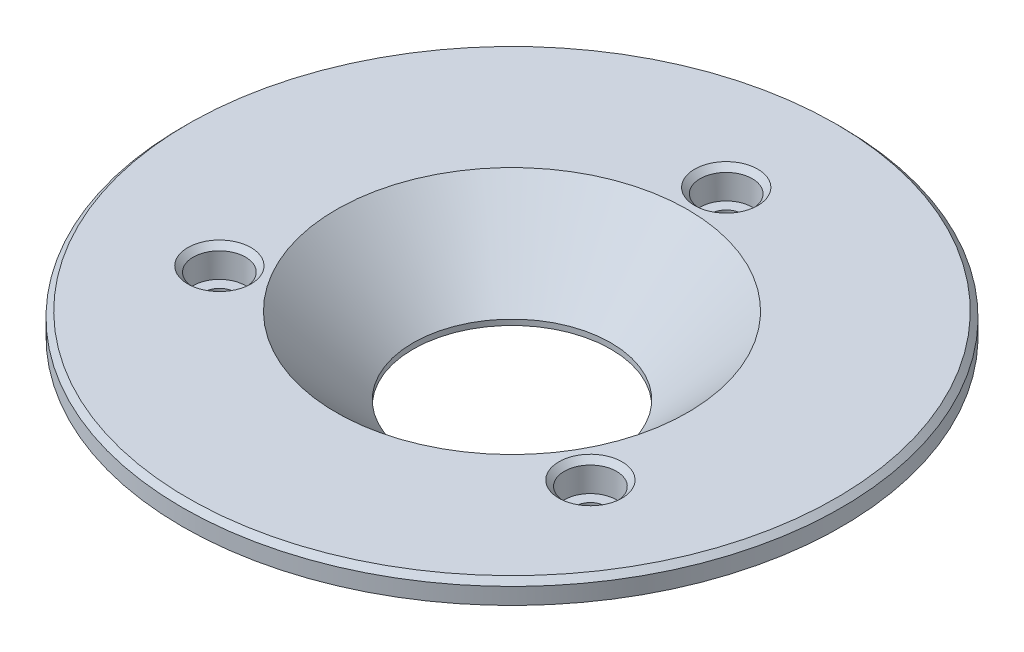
ISO-10303-21;
HEADER;
FILE_DESCRIPTION(('STEP AP214'),'2;1');
FILE_NAME('part.step','',(''),(''),'','','');
FILE_SCHEMA(('AUTOMOTIVE_DESIGN { 1 0 10303 214 1 1 1 1 }'));
ENDSEC;
DATA;
#1=APPLICATION_CONTEXT('core data for automotive mechanical design processes');
#2=APPLICATION_PROTOCOL_DEFINITION('international standard','automotive_design',2000,#1);
#3=PRODUCT_CONTEXT('',#1,'mechanical');
#4=PRODUCT('Part','Part','',(#3));
#5=PRODUCT_RELATED_PRODUCT_CATEGORY('part','',(#4));
#6=PRODUCT_DEFINITION_FORMATION('','',#4);
#7=PRODUCT_DEFINITION_CONTEXT('part definition',#1,'design');
#8=PRODUCT_DEFINITION('design','',#6,#7);
#9=PRODUCT_DEFINITION_SHAPE('','',#8);
#10=(LENGTH_UNIT() NAMED_UNIT(*) SI_UNIT(.MILLI.,.METRE.));
#11=(NAMED_UNIT(*) PLANE_ANGLE_UNIT() SI_UNIT($,.RADIAN.));
#12=(NAMED_UNIT(*) SI_UNIT($,.STERADIAN.) SOLID_ANGLE_UNIT());
#13=UNCERTAINTY_MEASURE_WITH_UNIT(LENGTH_MEASURE(1.E-05),#10,'distance_accuracy_value','');
#14=(GEOMETRIC_REPRESENTATION_CONTEXT(3) GLOBAL_UNCERTAINTY_ASSIGNED_CONTEXT((#13)) GLOBAL_UNIT_ASSIGNED_CONTEXT((#10,
#11,#12)) REPRESENTATION_CONTEXT('',''));
#15=CARTESIAN_POINT('',(0.,0.,0.));
#16=DIRECTION('',(0.,0.,1.));
#17=DIRECTION('',(1.,0.,0.));
#18=AXIS2_PLACEMENT_3D('',#15,#16,#17);
#19=CARTESIAN_POINT('',(-32.,15.,0.));
#20=DIRECTION('',(0.,-1.,0.));
#21=DIRECTION('',(0.,0.,-1.));
#22=AXIS2_PLACEMENT_3D('',#19,#20,#21);
#23=PLANE('',#22);
#24=CARTESIAN_POINT('',(33.7749907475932,15.,19.5));
#25=DIRECTION('',(0.,-1.,0.));
#26=DIRECTION('',(0.,0.,-1.));
#27=AXIS2_PLACEMENT_3D('',#24,#25,#26);
#28=CIRCLE('',#27,5.75);
#29=CARTESIAN_POINT('',(33.7749907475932,15.,13.75));
#30=VERTEX_POINT('',#29);
#31=EDGE_CURVE('E25',#30,#30,#28,.T.);
#32=ORIENTED_EDGE('',*,*,#31,.T.);
#33=EDGE_LOOP('',(#32));
#34=FACE_BOUND('',#33,.T.);
#35=CARTESIAN_POINT('',(0.,15.,-39.));
#36=DIRECTION('',(0.,-1.,0.));
#37=DIRECTION('',(0.,0.,-1.));
#38=AXIS2_PLACEMENT_3D('',#35,#36,#37);
#39=CIRCLE('',#38,5.75);
#40=CARTESIAN_POINT('',(0.,15.,-44.75));
#41=VERTEX_POINT('',#40);
#42=EDGE_CURVE('E29',#41,#41,#39,.T.);
#43=ORIENTED_EDGE('',*,*,#42,.T.);
#44=EDGE_LOOP('',(#43));
#45=FACE_BOUND('',#44,.T.);
#46=CARTESIAN_POINT('',(-33.7749907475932,15.,19.5));
#47=DIRECTION('',(0.,-1.,0.));
#48=DIRECTION('',(0.,0.,-1.));
#49=AXIS2_PLACEMENT_3D('',#46,#47,#48);
#50=CIRCLE('',#49,5.75);
#51=CARTESIAN_POINT('',(-33.7749907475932,15.,13.75));
#52=VERTEX_POINT('',#51);
#53=EDGE_CURVE('E34',#52,#52,#50,.T.);
#54=ORIENTED_EDGE('',*,*,#53,.T.);
#55=EDGE_LOOP('',(#54));
#56=FACE_BOUND('',#55,.T.);
#57=CARTESIAN_POINT('',(0.,15.,0.));
#58=DIRECTION('',(0.,-1.,0.));
#59=DIRECTION('',(0.,0.,-1.));
#60=AXIS2_PLACEMENT_3D('',#57,#58,#59);
#61=CIRCLE('',#60,59.);
#62=CARTESIAN_POINT('',(0.,15.,-59.));
#63=VERTEX_POINT('',#62);
#64=EDGE_CURVE('E58',#63,#63,#61,.F.);
#65=ORIENTED_EDGE('',*,*,#64,.T.);
#66=EDGE_LOOP('',(#65));
#67=FACE_BOUND('',#66,.T.);
#68=CARTESIAN_POINT('',(0.,15.,0.));
#69=DIRECTION('',(0.,-1.,0.));
#70=DIRECTION('',(0.,0.,-1.));
#71=AXIS2_PLACEMENT_3D('',#68,#69,#70);
#72=CIRCLE('',#71,32.);
#73=CARTESIAN_POINT('',(0.,15.,-32.));
#74=VERTEX_POINT('',#73);
#75=EDGE_CURVE('E70',#74,#74,#72,.T.);
#76=ORIENTED_EDGE('',*,*,#75,.T.);
#77=EDGE_LOOP('',(#76));
#78=FACE_BOUND('',#77,.T.);
#79=ADVANCED_FACE('F14',(#34,#45,#56,#67,#78),#23,.F.);
#80=CARTESIAN_POINT('',(0.,1.,0.));
#81=DIRECTION('',(0.,1.,0.));
#82=DIRECTION('',(0.,0.,1.));
#83=AXIS2_PLACEMENT_3D('',#80,#81,#82);
#84=CONICAL_SURFACE('',#83,18.,0.78539816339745);
#85=ORIENTED_EDGE('',*,*,#75,.F.);
#86=EDGE_LOOP('',(#85));
#87=FACE_BOUND('',#86,.T.);
#88=CARTESIAN_POINT('',(0.,1.,0.));
#89=DIRECTION('',(0.,-1.,0.));
#90=DIRECTION('',(0.,0.,-1.));
#91=AXIS2_PLACEMENT_3D('',#88,#89,#90);
#92=CIRCLE('',#91,18.);
#93=CARTESIAN_POINT('',(0.,1.,-18.));
#94=VERTEX_POINT('',#93);
#95=EDGE_CURVE('E83',#94,#94,#92,.T.);
#96=ORIENTED_EDGE('',*,*,#95,.T.);
#97=EDGE_LOOP('',(#96));
#98=FACE_BOUND('',#97,.T.);
#99=ADVANCED_FACE('F123',(#87,#98),#84,.F.);
#100=CARTESIAN_POINT('',(0.,0.,0.));
#101=DIRECTION('',(0.,-1.,0.));
#102=DIRECTION('',(0.,0.,-1.));
#103=AXIS2_PLACEMENT_3D('',#100,#101,#102);
#104=CYLINDRICAL_SURFACE('',#103,18.);
#105=ORIENTED_EDGE('',*,*,#95,.F.);
#106=EDGE_LOOP('',(#105));
#107=FACE_BOUND('',#106,.T.);
#108=CARTESIAN_POINT('',(0.,0.,0.));
#109=DIRECTION('',(0.,-1.,0.));
#110=DIRECTION('',(0.,0.,-1.));
#111=AXIS2_PLACEMENT_3D('',#108,#109,#110);
#112=CIRCLE('',#111,18.);
#113=CARTESIAN_POINT('',(0.,0.,-18.));
#114=VERTEX_POINT('',#113);
#115=EDGE_CURVE('E86',#114,#114,#112,.T.);
#116=ORIENTED_EDGE('',*,*,#115,.T.);
#117=EDGE_LOOP('',(#116));
#118=FACE_BOUND('',#117,.T.);
#119=ADVANCED_FACE('F130',(#107,#118),#104,.F.);
#120=CARTESIAN_POINT('',(-18.,0.,0.));
#121=DIRECTION('',(0.,1.,0.));
#122=DIRECTION('',(0.,0.,1.));
#123=AXIS2_PLACEMENT_3D('',#120,#121,#122);
#124=PLANE('',#123);
#125=CARTESIAN_POINT('',(-33.7749907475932,0.,19.5));
#126=DIRECTION('',(0.,1.,0.));
#127=DIRECTION('',(0.,0.,1.));
#128=AXIS2_PLACEMENT_3D('',#125,#126,#127);
#129=CIRCLE('',#128,3.74999999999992);
#130=CARTESIAN_POINT('',(-33.7749907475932,0.,23.2499999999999));
#131=VERTEX_POINT('',#130);
#132=EDGE_CURVE('E49',#131,#131,#129,.T.);
#133=ORIENTED_EDGE('',*,*,#132,.T.);
#134=EDGE_LOOP('',(#133));
#135=FACE_BOUND('',#134,.T.);
#136=CARTESIAN_POINT('',(33.7749907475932,0.,19.5));
#137=DIRECTION('',(0.,1.,0.));
#138=DIRECTION('',(0.,0.,1.));
#139=AXIS2_PLACEMENT_3D('',#136,#137,#138);
#140=CIRCLE('',#139,3.74999999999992);
#141=CARTESIAN_POINT('',(33.7749907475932,0.,23.2499999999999));
#142=VERTEX_POINT('',#141);
#143=EDGE_CURVE('E52',#142,#142,#140,.T.);
#144=ORIENTED_EDGE('',*,*,#143,.T.);
#145=EDGE_LOOP('',(#144));
#146=FACE_BOUND('',#145,.T.);
#147=CARTESIAN_POINT('',(0.,0.,-39.));
#148=DIRECTION('',(0.,1.,0.));
#149=DIRECTION('',(0.,0.,1.));
#150=AXIS2_PLACEMENT_3D('',#147,#148,#149);
#151=CIRCLE('',#150,3.74999999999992);
#152=CARTESIAN_POINT('',(0.,0.,-35.2500000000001));
#153=VERTEX_POINT('',#152);
#154=EDGE_CURVE('E55',#153,#153,#151,.T.);
#155=ORIENTED_EDGE('',*,*,#154,.T.);
#156=EDGE_LOOP('',(#155));
#157=FACE_BOUND('',#156,.T.);
#158=CARTESIAN_POINT('',(0.,0.,0.));
#159=DIRECTION('',(0.,1.,0.));
#160=DIRECTION('',(0.,0.,1.));
#161=AXIS2_PLACEMENT_3D('',#158,#159,#160);
#162=CIRCLE('',#161,44.);
#163=CARTESIAN_POINT('',(0.,0.,44.));
#164=VERTEX_POINT('',#163);
#165=EDGE_CURVE('E67',#164,#164,#162,.F.);
#166=ORIENTED_EDGE('',*,*,#165,.T.);
#167=EDGE_LOOP('',(#166));
#168=FACE_BOUND('',#167,.T.);
#169=ORIENTED_EDGE('',*,*,#115,.F.);
#170=EDGE_LOOP('',(#169));
#171=FACE_BOUND('',#170,.T.);
#172=ADVANCED_FACE('F181',(#135,#146,#157,#168,#171),#124,.F.);
#173=CARTESIAN_POINT('',(0.,0.,0.));
#174=DIRECTION('',(0.,-1.,0.));
#175=DIRECTION('',(0.,0.,-1.));
#176=AXIS2_PLACEMENT_3D('',#173,#174,#175);
#177=CYLINDRICAL_SURFACE('',#176,45.);
#178=CARTESIAN_POINT('',(0.,0.999999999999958,0.));
#179=DIRECTION('',(0.,1.,0.));
#180=DIRECTION('',(0.,0.,1.));
#181=AXIS2_PLACEMENT_3D('',#178,#179,#180);
#182=CIRCLE('',#181,45.);
#183=CARTESIAN_POINT('',(0.,0.999999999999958,45.));
#184=VERTEX_POINT('',#183);
#185=EDGE_CURVE('E64',#184,#184,#182,.T.);
#186=ORIENTED_EDGE('',*,*,#185,.T.);
#187=EDGE_LOOP('',(#186));
#188=FACE_BOUND('',#187,.T.);
#189=CARTESIAN_POINT('',(0.,11.,0.));
#190=DIRECTION('',(0.,-1.,0.));
#191=DIRECTION('',(0.,0.,-1.));
#192=AXIS2_PLACEMENT_3D('',#189,#190,#191);
#193=CIRCLE('',#192,45.);
#194=CARTESIAN_POINT('',(0.,11.,-45.));
#195=VERTEX_POINT('',#194);
#196=EDGE_CURVE('E89',#195,#195,#193,.T.);
#197=ORIENTED_EDGE('',*,*,#196,.T.);
#198=EDGE_LOOP('',(#197));
#199=FACE_BOUND('',#198,.T.);
#200=ADVANCED_FACE('F185',(#188,#199),#177,.T.);
#201=CARTESIAN_POINT('',(-45.,11.,0.));
#202=DIRECTION('',(0.,1.,0.));
#203=DIRECTION('',(0.,0.,1.));
#204=AXIS2_PLACEMENT_3D('',#201,#202,#203);
#205=PLANE('',#204);
#206=ORIENTED_EDGE('',*,*,#196,.F.);
#207=EDGE_LOOP('',(#206));
#208=FACE_BOUND('',#207,.T.);
#209=CARTESIAN_POINT('',(0.,11.,0.));
#210=DIRECTION('',(0.,-1.,0.));
#211=DIRECTION('',(0.,0.,-1.));
#212=AXIS2_PLACEMENT_3D('',#209,#210,#211);
#213=CIRCLE('',#212,60.);
#214=CARTESIAN_POINT('',(0.,11.,-60.));
#215=VERTEX_POINT('',#214);
#216=EDGE_CURVE('E92',#215,#215,#213,.T.);
#217=ORIENTED_EDGE('',*,*,#216,.T.);
#218=EDGE_LOOP('',(#217));
#219=FACE_BOUND('',#218,.T.);
#220=ADVANCED_FACE('F192',(#208,#219),#205,.F.);
#221=CARTESIAN_POINT('',(0.,0.,0.));
#222=DIRECTION('',(0.,-1.,0.));
#223=DIRECTION('',(0.,0.,-1.));
#224=AXIS2_PLACEMENT_3D('',#221,#222,#223);
#225=CYLINDRICAL_SURFACE('',#224,60.);
#226=CARTESIAN_POINT('',(0.,14.,0.));
#227=DIRECTION('',(0.,-1.,0.));
#228=DIRECTION('',(0.,0.,-1.));
#229=AXIS2_PLACEMENT_3D('',#226,#227,#228);
#230=CIRCLE('',#229,60.);
#231=CARTESIAN_POINT('',(0.,14.,-60.));
#232=VERTEX_POINT('',#231);
#233=EDGE_CURVE('E61',#232,#232,#230,.T.);
#234=ORIENTED_EDGE('',*,*,#233,.T.);
#235=EDGE_LOOP('',(#234));
#236=FACE_BOUND('',#235,.T.);
#237=ORIENTED_EDGE('',*,*,#216,.F.);
#238=EDGE_LOOP('',(#237));
#239=FACE_BOUND('',#238,.T.);
#240=ADVANCED_FACE('F199',(#236,#239),#225,.T.);
#241=CARTESIAN_POINT('',(33.7749907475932,9.5,19.5));
#242=DIRECTION('',(0.,1.,0.));
#243=DIRECTION('',(0.,0.,1.));
#244=AXIS2_PLACEMENT_3D('',#241,#242,#243);
#245=CYLINDRICAL_SURFACE('',#244,4.75);
#246=CARTESIAN_POINT('',(33.7749907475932,14.,19.5));
#247=DIRECTION('',(0.,-1.,0.));
#248=DIRECTION('',(0.,0.,-1.));
#249=AXIS2_PLACEMENT_3D('',#246,#247,#248);
#250=CIRCLE('',#249,4.75);
#251=CARTESIAN_POINT('',(33.7749907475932,14.,14.75));
#252=VERTEX_POINT('',#251);
#253=EDGE_CURVE('E37',#252,#252,#250,.F.);
#254=ORIENTED_EDGE('',*,*,#253,.T.);
#255=EDGE_LOOP('',(#254));
#256=FACE_BOUND('',#255,.T.);
#257=CARTESIAN_POINT('',(33.7749907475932,9.5,19.5));
#258=DIRECTION('',(0.,1.,0.));
#259=DIRECTION('',(0.,0.,-1.));
#260=AXIS2_PLACEMENT_3D('',#257,#258,#259);
#261=CIRCLE('',#260,4.75);
#262=CARTESIAN_POINT('',(33.7749907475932,9.5,14.75));
#263=VERTEX_POINT('',#262);
#264=EDGE_CURVE('E74',#263,#263,#261,.T.);
#265=ORIENTED_EDGE('',*,*,#264,.F.);
#266=EDGE_LOOP('',(#265));
#267=FACE_BOUND('',#266,.T.);
#268=ADVANCED_FACE('F203',(#256,#267),#245,.F.);
#269=CARTESIAN_POINT('',(33.7749907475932,9.5,19.5));
#270=DIRECTION('',(0.,-1.,0.));
#271=DIRECTION('',(0.,0.,-1.));
#272=AXIS2_PLACEMENT_3D('',#269,#270,#271);
#273=PLANE('',#272);
#274=CARTESIAN_POINT('',(33.7749907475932,9.5,19.5));
#275=DIRECTION('',(0.,-1.,0.));
#276=DIRECTION('',(0.,0.,-1.));
#277=AXIS2_PLACEMENT_3D('',#274,#275,#276);
#278=CIRCLE('',#277,2.75);
#279=CARTESIAN_POINT('',(33.7749907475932,9.5,16.75));
#280=VERTEX_POINT('',#279);
#281=EDGE_CURVE('E71',#280,#280,#278,.T.);
#282=ORIENTED_EDGE('',*,*,#281,.T.);
#283=EDGE_LOOP('',(#282));
#284=FACE_BOUND('',#283,.T.);
#285=ORIENTED_EDGE('',*,*,#264,.T.);
#286=EDGE_LOOP('',(#285));
#287=FACE_BOUND('',#286,.T.);
#288=ADVANCED_FACE('F207',(#284,#287),#273,.F.);
#289=CARTESIAN_POINT('',(-33.7749907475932,9.5,19.5));
#290=DIRECTION('',(0.,1.,0.));
#291=DIRECTION('',(0.,0.,1.));
#292=AXIS2_PLACEMENT_3D('',#289,#290,#291);
#293=CYLINDRICAL_SURFACE('',#292,4.75);
#294=CARTESIAN_POINT('',(-33.7749907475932,14.,19.5));
#295=DIRECTION('',(0.,-1.,0.));
#296=DIRECTION('',(0.,0.,-1.));
#297=AXIS2_PLACEMENT_3D('',#294,#295,#296);
#298=CIRCLE('',#297,4.75);
#299=CARTESIAN_POINT('',(-33.7749907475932,14.,14.75));
#300=VERTEX_POINT('',#299);
#301=EDGE_CURVE('E9',#300,#300,#298,.F.);
#302=ORIENTED_EDGE('',*,*,#301,.T.);
#303=EDGE_LOOP('',(#302));
#304=FACE_BOUND('',#303,.T.);
#305=CARTESIAN_POINT('',(-33.7749907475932,9.5,19.5));
#306=DIRECTION('',(0.,1.,0.));
#307=DIRECTION('',(0.,0.,1.));
#308=AXIS2_PLACEMENT_3D('',#305,#306,#307);
#309=CIRCLE('',#308,4.75);
#310=CARTESIAN_POINT('',(-33.7749907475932,9.5,24.25));
#311=VERTEX_POINT('',#310);
#312=EDGE_CURVE('E98',#311,#311,#309,.T.);
#313=ORIENTED_EDGE('',*,*,#312,.F.);
#314=EDGE_LOOP('',(#313));
#315=FACE_BOUND('',#314,.T.);
#316=ADVANCED_FACE('F119',(#304,#315),#293,.F.);
#317=CARTESIAN_POINT('',(-33.7749907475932,9.5,19.5));
#318=DIRECTION('',(0.,1.,0.));
#319=DIRECTION('',(0.,0.,1.));
#320=AXIS2_PLACEMENT_3D('',#317,#318,#319);
#321=PLANE('',#320);
#322=CARTESIAN_POINT('',(-33.7749907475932,9.5,19.5));
#323=DIRECTION('',(0.,1.,0.));
#324=DIRECTION('',(0.,0.,1.));
#325=AXIS2_PLACEMENT_3D('',#322,#323,#324);
#326=CIRCLE('',#325,2.75);
#327=CARTESIAN_POINT('',(-33.7749907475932,9.5,22.25));
#328=VERTEX_POINT('',#327);
#329=EDGE_CURVE('E75',#328,#328,#326,.T.);
#330=ORIENTED_EDGE('',*,*,#329,.F.);
#331=EDGE_LOOP('',(#330));
#332=FACE_BOUND('',#331,.T.);
#333=ORIENTED_EDGE('',*,*,#312,.T.);
#334=EDGE_LOOP('',(#333));
#335=FACE_BOUND('',#334,.T.);
#336=ADVANCED_FACE('F108',(#332,#335),#321,.T.);
#337=CARTESIAN_POINT('',(0.,9.5,-39.));
#338=DIRECTION('',(0.,1.,0.));
#339=DIRECTION('',(0.,0.,1.));
#340=AXIS2_PLACEMENT_3D('',#337,#338,#339);
#341=CYLINDRICAL_SURFACE('',#340,4.75);
#342=CARTESIAN_POINT('',(0.,14.,-39.));
#343=DIRECTION('',(0.,-1.,0.));
#344=DIRECTION('',(0.,0.,-1.));
#345=AXIS2_PLACEMENT_3D('',#342,#343,#344);
#346=CIRCLE('',#345,4.75);
#347=CARTESIAN_POINT('',(0.,14.,-43.75));
#348=VERTEX_POINT('',#347);
#349=EDGE_CURVE('E21',#348,#348,#346,.F.);
#350=ORIENTED_EDGE('',*,*,#349,.T.);
#351=EDGE_LOOP('',(#350));
#352=FACE_BOUND('',#351,.T.);
#353=CARTESIAN_POINT('',(0.,9.5,-39.));
#354=DIRECTION('',(0.,1.,0.));
#355=DIRECTION('',(0.,0.,1.));
#356=AXIS2_PLACEMENT_3D('',#353,#354,#355);
#357=CIRCLE('',#356,4.75);
#358=CARTESIAN_POINT('',(0.,9.5,-34.25));
#359=VERTEX_POINT('',#358);
#360=EDGE_CURVE('E95',#359,#359,#357,.T.);
#361=ORIENTED_EDGE('',*,*,#360,.F.);
#362=EDGE_LOOP('',(#361));
#363=FACE_BOUND('',#362,.T.);
#364=ADVANCED_FACE('F106',(#352,#363),#341,.F.);
#365=CARTESIAN_POINT('',(0.,9.5,-39.));
#366=DIRECTION('',(0.,1.,0.));
#367=DIRECTION('',(0.,0.,1.));
#368=AXIS2_PLACEMENT_3D('',#365,#366,#367);
#369=PLANE('',#368);
#370=CARTESIAN_POINT('',(0.,9.5,-39.));
#371=DIRECTION('',(0.,1.,0.));
#372=DIRECTION('',(0.,0.,1.));
#373=AXIS2_PLACEMENT_3D('',#370,#371,#372);
#374=CIRCLE('',#373,2.75);
#375=CARTESIAN_POINT('',(0.,9.5,-36.25));
#376=VERTEX_POINT('',#375);
#377=EDGE_CURVE('E78',#376,#376,#374,.T.);
#378=ORIENTED_EDGE('',*,*,#377,.F.);
#379=EDGE_LOOP('',(#378));
#380=FACE_BOUND('',#379,.T.);
#381=ORIENTED_EDGE('',*,*,#360,.T.);
#382=EDGE_LOOP('',(#381));
#383=FACE_BOUND('',#382,.T.);
#384=ADVANCED_FACE('F104',(#380,#383),#369,.T.);
#385=CARTESIAN_POINT('',(0.,0.,-39.));
#386=DIRECTION('',(0.,1.,0.));
#387=DIRECTION('',(0.,0.,1.));
#388=AXIS2_PLACEMENT_3D('',#385,#386,#387);
#389=CYLINDRICAL_SURFACE('',#388,2.75);
#390=CARTESIAN_POINT('',(0.,0.999999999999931,-39.));
#391=DIRECTION('',(0.,1.,0.));
#392=DIRECTION('',(0.,0.,1.));
#393=AXIS2_PLACEMENT_3D('',#390,#391,#392);
#394=CIRCLE('',#393,2.75);
#395=CARTESIAN_POINT('',(0.,0.999999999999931,-36.25));
#396=VERTEX_POINT('',#395);
#397=EDGE_CURVE('E40',#396,#396,#394,.F.);
#398=ORIENTED_EDGE('',*,*,#397,.T.);
#399=EDGE_LOOP('',(#398));
#400=FACE_BOUND('',#399,.T.);
#401=ORIENTED_EDGE('',*,*,#377,.T.);
#402=EDGE_LOOP('',(#401));
#403=FACE_BOUND('',#402,.T.);
#404=ADVANCED_FACE('F116',(#400,#403),#389,.F.);
#405=CARTESIAN_POINT('',(-33.7749907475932,0.,19.5));
#406=DIRECTION('',(0.,1.,0.));
#407=DIRECTION('',(0.,0.,1.));
#408=AXIS2_PLACEMENT_3D('',#405,#406,#407);
#409=CYLINDRICAL_SURFACE('',#408,2.75);
#410=CARTESIAN_POINT('',(-33.7749907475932,0.999999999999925,19.5));
#411=DIRECTION('',(0.,1.,0.));
#412=DIRECTION('',(0.,0.,1.));
#413=AXIS2_PLACEMENT_3D('',#410,#411,#412);
#414=CIRCLE('',#413,2.75);
#415=CARTESIAN_POINT('',(-33.7749907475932,0.999999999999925,22.25));
#416=VERTEX_POINT('',#415);
#417=EDGE_CURVE('E46',#416,#416,#414,.F.);
#418=ORIENTED_EDGE('',*,*,#417,.T.);
#419=EDGE_LOOP('',(#418));
#420=FACE_BOUND('',#419,.T.);
#421=ORIENTED_EDGE('',*,*,#329,.T.);
#422=EDGE_LOOP('',(#421));
#423=FACE_BOUND('',#422,.T.);
#424=ADVANCED_FACE('F338',(#420,#423),#409,.F.);
#425=CARTESIAN_POINT('',(33.7749907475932,0.,19.5));
#426=DIRECTION('',(0.,1.,0.));
#427=DIRECTION('',(0.,0.,1.));
#428=AXIS2_PLACEMENT_3D('',#425,#426,#427);
#429=CYLINDRICAL_SURFACE('',#428,2.75);
#430=CARTESIAN_POINT('',(33.7749907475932,0.99999999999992,19.5));
#431=DIRECTION('',(0.,1.,0.));
#432=DIRECTION('',(0.,0.,1.));
#433=AXIS2_PLACEMENT_3D('',#430,#431,#432);
#434=CIRCLE('',#433,2.75);
#435=CARTESIAN_POINT('',(33.7749907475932,0.99999999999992,22.25));
#436=VERTEX_POINT('',#435);
#437=EDGE_CURVE('E43',#436,#436,#434,.F.);
#438=ORIENTED_EDGE('',*,*,#437,.T.);
#439=EDGE_LOOP('',(#438));
#440=FACE_BOUND('',#439,.T.);
#441=ORIENTED_EDGE('',*,*,#281,.F.);
#442=EDGE_LOOP('',(#441));
#443=FACE_BOUND('',#442,.T.);
#444=ADVANCED_FACE('F140',(#440,#443),#429,.F.);
#445=CARTESIAN_POINT('',(0.,0.,0.));
#446=DIRECTION('',(0.,1.,0.));
#447=DIRECTION('',(0.,0.,1.));
#448=AXIS2_PLACEMENT_3D('',#445,#446,#447);
#449=CONICAL_SURFACE('',#448,44.,0.785398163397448);
#450=ORIENTED_EDGE('',*,*,#185,.F.);
#451=EDGE_LOOP('',(#450));
#452=FACE_BOUND('',#451,.T.);
#453=ORIENTED_EDGE('',*,*,#165,.F.);
#454=EDGE_LOOP('',(#453));
#455=FACE_BOUND('',#454,.T.);
#456=ADVANCED_FACE('F136',(#452,#455),#449,.T.);
#457=CARTESIAN_POINT('',(0.,14.,0.));
#458=DIRECTION('',(0.,-1.,0.));
#459=DIRECTION('',(0.,0.,-1.));
#460=AXIS2_PLACEMENT_3D('',#457,#458,#459);
#461=CONICAL_SURFACE('',#460,60.,0.785398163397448);
#462=ORIENTED_EDGE('',*,*,#64,.F.);
#463=EDGE_LOOP('',(#462));
#464=FACE_BOUND('',#463,.T.);
#465=ORIENTED_EDGE('',*,*,#233,.F.);
#466=EDGE_LOOP('',(#465));
#467=FACE_BOUND('',#466,.T.);
#468=ADVANCED_FACE('F139',(#464,#467),#461,.T.);
#469=CARTESIAN_POINT('',(-33.7749907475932,0.,19.5));
#470=DIRECTION('',(0.,-1.,0.));
#471=DIRECTION('',(0.,0.,-1.));
#472=AXIS2_PLACEMENT_3D('',#469,#470,#471);
#473=CONICAL_SURFACE('',#472,3.74999999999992,0.785398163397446);
#474=ORIENTED_EDGE('',*,*,#417,.F.);
#475=EDGE_LOOP('',(#474));
#476=FACE_BOUND('',#475,.T.);
#477=ORIENTED_EDGE('',*,*,#132,.F.);
#478=EDGE_LOOP('',(#477));
#479=FACE_BOUND('',#478,.T.);
#480=ADVANCED_FACE('F144',(#476,#479),#473,.F.);
#481=CARTESIAN_POINT('',(33.7749907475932,0.,19.5));
#482=DIRECTION('',(0.,-1.,0.));
#483=DIRECTION('',(0.,0.,-1.));
#484=AXIS2_PLACEMENT_3D('',#481,#482,#483);
#485=CONICAL_SURFACE('',#484,3.74999999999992,0.785398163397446);
#486=ORIENTED_EDGE('',*,*,#437,.F.);
#487=EDGE_LOOP('',(#486));
#488=FACE_BOUND('',#487,.T.);
#489=ORIENTED_EDGE('',*,*,#143,.F.);
#490=EDGE_LOOP('',(#489));
#491=FACE_BOUND('',#490,.T.);
#492=ADVANCED_FACE('F148',(#488,#491),#485,.F.);
#493=CARTESIAN_POINT('',(0.,0.,-39.));
#494=DIRECTION('',(0.,-1.,0.));
#495=DIRECTION('',(0.,0.,-1.));
#496=AXIS2_PLACEMENT_3D('',#493,#494,#495);
#497=CONICAL_SURFACE('',#496,3.74999999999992,0.785398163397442);
#498=ORIENTED_EDGE('',*,*,#397,.F.);
#499=EDGE_LOOP('',(#498));
#500=FACE_BOUND('',#499,.T.);
#501=ORIENTED_EDGE('',*,*,#154,.F.);
#502=EDGE_LOOP('',(#501));
#503=FACE_BOUND('',#502,.T.);
#504=ADVANCED_FACE('F152',(#500,#503),#497,.F.);
#505=CARTESIAN_POINT('',(33.7749907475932,14.,19.5));
#506=DIRECTION('',(0.,1.,0.));
#507=DIRECTION('',(0.,0.,1.));
#508=AXIS2_PLACEMENT_3D('',#505,#506,#507);
#509=CONICAL_SURFACE('',#508,4.75,0.785398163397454);
#510=ORIENTED_EDGE('',*,*,#31,.F.);
#511=EDGE_LOOP('',(#510));
#512=FACE_BOUND('',#511,.T.);
#513=ORIENTED_EDGE('',*,*,#253,.F.);
#514=EDGE_LOOP('',(#513));
#515=FACE_BOUND('',#514,.T.);
#516=ADVANCED_FACE('F156',(#512,#515),#509,.F.);
#517=CARTESIAN_POINT('',(0.,14.,-39.));
#518=DIRECTION('',(0.,1.,0.));
#519=DIRECTION('',(0.,0.,1.));
#520=AXIS2_PLACEMENT_3D('',#517,#518,#519);
#521=CONICAL_SURFACE('',#520,4.75,0.785398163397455);
#522=ORIENTED_EDGE('',*,*,#42,.F.);
#523=EDGE_LOOP('',(#522));
#524=FACE_BOUND('',#523,.T.);
#525=ORIENTED_EDGE('',*,*,#349,.F.);
#526=EDGE_LOOP('',(#525));
#527=FACE_BOUND('',#526,.T.);
#528=ADVANCED_FACE('F159',(#524,#527),#521,.F.);
#529=CARTESIAN_POINT('',(-33.7749907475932,14.,19.5));
#530=DIRECTION('',(0.,1.,0.));
#531=DIRECTION('',(0.,0.,1.));
#532=AXIS2_PLACEMENT_3D('',#529,#530,#531);
#533=CONICAL_SURFACE('',#532,4.75,0.785398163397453);
#534=ORIENTED_EDGE('',*,*,#53,.F.);
#535=EDGE_LOOP('',(#534));
#536=FACE_BOUND('',#535,.T.);
#537=ORIENTED_EDGE('',*,*,#301,.F.);
#538=EDGE_LOOP('',(#537));
#539=FACE_BOUND('',#538,.T.);
#540=ADVANCED_FACE('F16',(#536,#539),#533,.F.);
#541=CLOSED_SHELL('',(#79,#99,#119,#172,#200,#220,#240,#268,#288,#316,#336,#364,#384,#404,#424,
#444,#456,#468,#480,#492,#504,#516,#528,#540));
#542=MANIFOLD_SOLID_BREP('B1',#541);
#543=ADVANCED_BREP_SHAPE_REPRESENTATION('',(#18,#542),#14);
#544=SHAPE_DEFINITION_REPRESENTATION(#9,#543);
ENDSEC;
END-ISO-10303-21;
